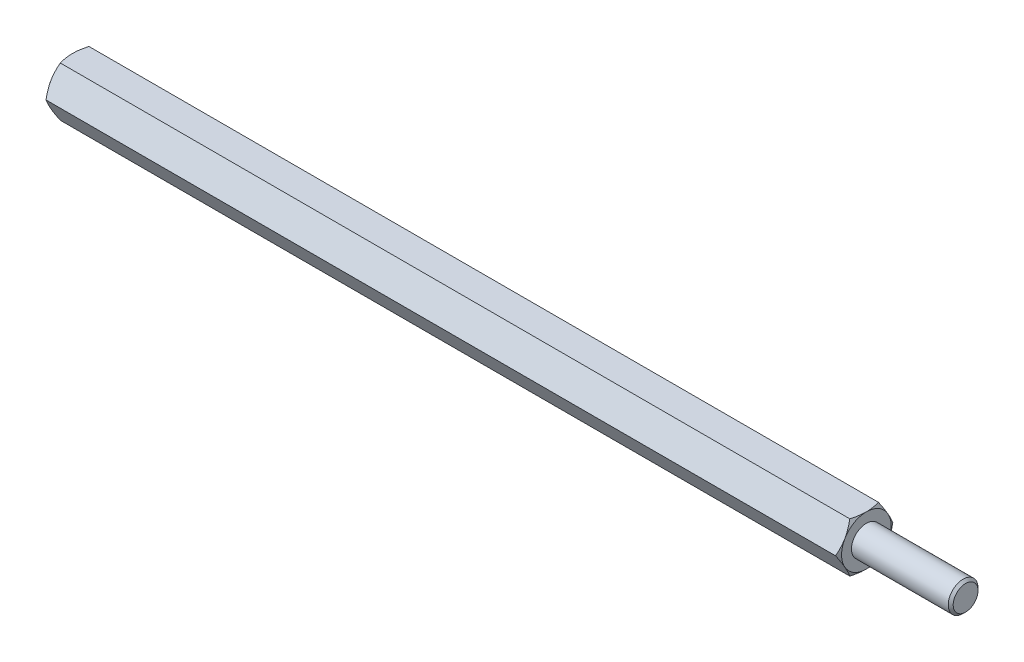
from build123d import *

# Parameters (mm, degrees)
EXTRUDE2_DEPTH = 40
SKETCH3_R      = 1.25
EXTRUDE3_DEPTH = 10
SKETCH5_R      = 1.5
EXTRUDE4_DEPTH = 10
CHAMFER1_SIZE  = 0.25


with BuildPart() as part:
    # Sketch1 → Extrude2 (new, symmetric)
    with BuildSketch(Plane(origin=(0, 0, 0), x_dir=(0, 0, -1), z_dir=(1, 0, 0))):
        Polygon((1.443375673, 2.5), (-1.443375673, 2.5), (-2.886751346, 0), (-1.443375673, -2.5), (1.443375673, -2.5), (2.886751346, 0), align=None)
    extrude(amount=EXTRUDE2_DEPTH, both=True)

    # Sketch2 → Cut-Revolve1 (revolve, cut)
    with BuildSketch(Plane.XY):
        with BuildLine():
            Line((-40, 2.5), (-38.5, 5.098076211))
            ThreePointArc((-38.5, 5.098076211), (-38.98810136, 6.276457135), (-40, 5.5))
            Line((-40, 5.5), (-40, 2.5))
        make_face()
    cut_revolve1 = revolve(axis=Axis((0, 0, 0), (1, 0, 0)), mode=Mode.SUBTRACT)

    # Mirror1: Cut-Revolve1 across plane
    add(cut_revolve1.mirror(Plane(origin=(0, 0, 0), x_dir=(0, 0, 1), z_dir=(1, 0, 0))), mode=Mode.SUBTRACT)

    # Sketch3 → Extrude3 (cut)
    with BuildSketch(Plane.ZY.offset(40)):
        Circle(SKETCH3_R)
    extrude(amount=-EXTRUDE3_DEPTH, mode=Mode.SUBTRACT)

    # Sketch4 → Cut-Revolve2 (revolve, cut)
    with BuildSketch(Plane.XY, mode=Mode.PRIVATE) as cut_revolve2_sk:
        Polygon((-30, 0), (-30, 1.25), (-29.278312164, 0), align=None)
    revolve(cut_revolve2_sk.sketch.rotate(Axis((-29.278312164, 0, 0), (-1, 0, 0)), 270), axis=Axis((-29.278312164, 0, 0), (-1, 0, 0)), mode=Mode.SUBTRACT)

    # Sketch5 → Extrude4 (add)
    with BuildSketch(Plane(origin=(40, 0, 0), x_dir=(0, 0, -1), z_dir=(1, 0, 0))):
        Circle(SKETCH5_R)
    extrude(amount=EXTRUDE4_DEPTH)

    # Chamfer1
    chamfer1_edges = [part.edges().sort_by_distance(p)[0] for p in [
        (50, 0, 1.5),
    ]]
    chamfer(chamfer1_edges, length=CHAMFER1_SIZE)


solid = part.part
